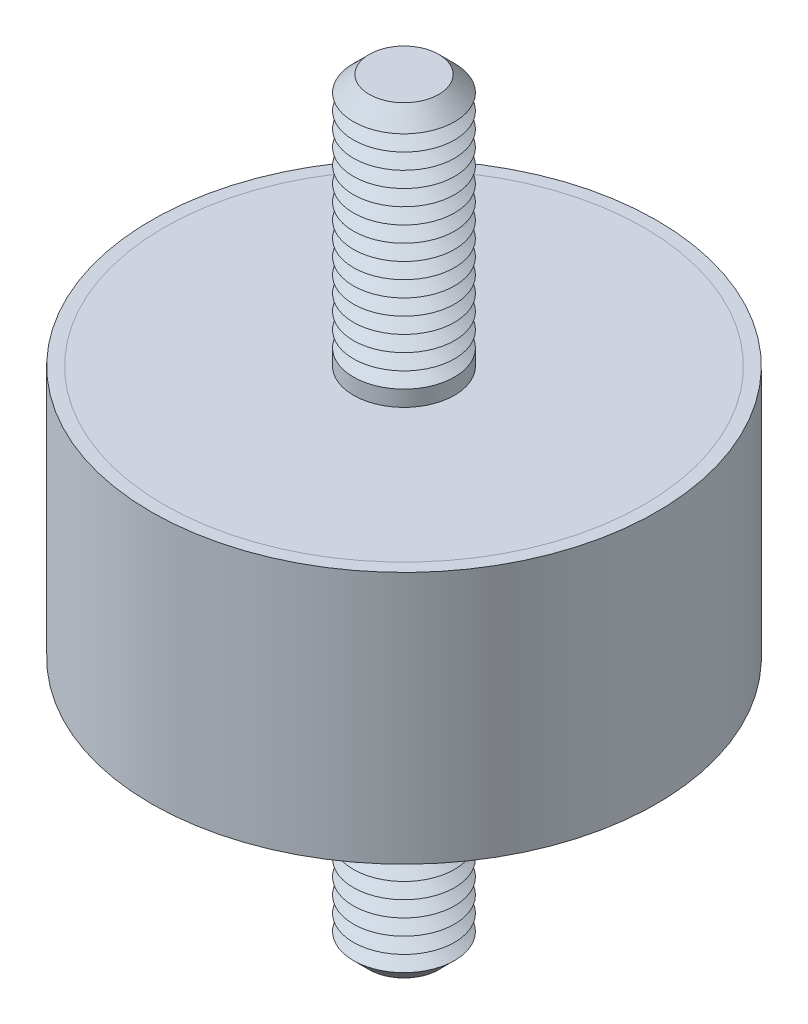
ISO-10303-21;
HEADER;
FILE_DESCRIPTION(('STEP AP214'),'2;1');
FILE_NAME('part.step','',(''),(''),'','','');
FILE_SCHEMA(('AUTOMOTIVE_DESIGN { 1 0 10303 214 1 1 1 1 }'));
ENDSEC;
DATA;
#1=APPLICATION_CONTEXT('core data for automotive mechanical design processes');
#2=APPLICATION_PROTOCOL_DEFINITION('international standard','automotive_design',2000,#1);
#3=PRODUCT_CONTEXT('',#1,'mechanical');
#4=PRODUCT('Part','Part','',(#3));
#5=PRODUCT_RELATED_PRODUCT_CATEGORY('part','',(#4));
#6=PRODUCT_DEFINITION_FORMATION('','',#4);
#7=PRODUCT_DEFINITION_CONTEXT('part definition',#1,'design');
#8=PRODUCT_DEFINITION('design','',#6,#7);
#9=PRODUCT_DEFINITION_SHAPE('','',#8);
#10=(LENGTH_UNIT() NAMED_UNIT(*) SI_UNIT(.MILLI.,.METRE.));
#11=(NAMED_UNIT(*) PLANE_ANGLE_UNIT() SI_UNIT($,.RADIAN.));
#12=(NAMED_UNIT(*) SI_UNIT($,.STERADIAN.) SOLID_ANGLE_UNIT());
#13=UNCERTAINTY_MEASURE_WITH_UNIT(LENGTH_MEASURE(1.E-05),#10,'distance_accuracy_value','');
#14=(GEOMETRIC_REPRESENTATION_CONTEXT(3) GLOBAL_UNCERTAINTY_ASSIGNED_CONTEXT((#13)) GLOBAL_UNIT_ASSIGNED_CONTEXT((#10,
#11,#12)) REPRESENTATION_CONTEXT('',''));
#15=CARTESIAN_POINT('',(0.,0.,0.));
#16=DIRECTION('',(0.,0.,1.));
#17=DIRECTION('',(1.,0.,0.));
#18=AXIS2_PLACEMENT_3D('',#15,#16,#17);
#19=CARTESIAN_POINT('',(0.,-30.,0.));
#20=DIRECTION('',(0.,1.,0.));
#21=DIRECTION('',(0.,0.,1.));
#22=AXIS2_PLACEMENT_3D('',#19,#20,#21);
#23=CYLINDRICAL_SURFACE('',#22,4.);
#24=CARTESIAN_POINT('',(0.,-10.,0.));
#25=DIRECTION('',(0.,-1.,0.));
#26=DIRECTION('',(0.,0.,-1.));
#27=AXIS2_PLACEMENT_3D('',#24,#25,#26);
#28=CIRCLE('',#27,4.);
#29=CARTESIAN_POINT('',(0.,-10.,-4.));
#30=VERTEX_POINT('',#29);
#31=EDGE_CURVE('P0_E21',#30,#30,#28,.T.);
#32=ORIENTED_EDGE('',*,*,#31,.T.);
#33=EDGE_LOOP('',(#32));
#34=FACE_BOUND('',#33,.T.);
#35=CARTESIAN_POINT('',(0.,-11.25,0.));
#36=DIRECTION('',(0.,1.,0.));
#37=DIRECTION('',(0.,0.,1.));
#38=AXIS2_PLACEMENT_3D('',#35,#36,#37);
#39=CIRCLE('',#38,4.);
#40=CARTESIAN_POINT('',(0.,-11.25,4.));
#41=VERTEX_POINT('',#40);
#42=EDGE_CURVE('P0_E33',#41,#41,#39,.T.);
#43=ORIENTED_EDGE('',*,*,#42,.T.);
#44=EDGE_LOOP('',(#43));
#45=FACE_BOUND('',#44,.T.);
#46=ADVANCED_FACE('P0_F14',(#34,#45),#23,.T.);
#47=CARTESIAN_POINT('',(0.,-10.,0.));
#48=DIRECTION('',(0.,1.,0.));
#49=DIRECTION('',(0.,0.,1.));
#50=AXIS2_PLACEMENT_3D('',#47,#48,#49);
#51=CYLINDRICAL_SURFACE('',#50,19.);
#52=CARTESIAN_POINT('',(0.,-10.,0.));
#53=DIRECTION('',(0.,1.,0.));
#54=DIRECTION('',(0.,0.,1.));
#55=AXIS2_PLACEMENT_3D('',#52,#53,#54);
#56=CIRCLE('',#55,19.);
#57=CARTESIAN_POINT('',(0.,-10.,19.));
#58=VERTEX_POINT('',#57);
#59=EDGE_CURVE('P0_E25',#58,#58,#56,.T.);
#60=ORIENTED_EDGE('',*,*,#59,.T.);
#61=EDGE_LOOP('',(#60));
#62=FACE_BOUND('',#61,.T.);
#63=CARTESIAN_POINT('',(0.,-9.,0.));
#64=DIRECTION('',(0.,1.,0.));
#65=DIRECTION('',(0.,0.,1.));
#66=AXIS2_PLACEMENT_3D('',#63,#64,#65);
#67=CIRCLE('',#66,19.);
#68=CARTESIAN_POINT('',(0.,-9.,19.));
#69=VERTEX_POINT('',#68);
#70=EDGE_CURVE('P0_E30',#69,#69,#67,.T.);
#71=ORIENTED_EDGE('',*,*,#70,.F.);
#72=EDGE_LOOP('',(#71));
#73=FACE_BOUND('',#72,.T.);
#74=ADVANCED_FACE('P0_F145',(#62,#73),#51,.T.);
#75=CARTESIAN_POINT('',(0.,-10.,0.));
#76=DIRECTION('',(0.,1.,0.));
#77=DIRECTION('',(0.,0.,1.));
#78=AXIS2_PLACEMENT_3D('',#75,#76,#77);
#79=PLANE('',#78);
#80=ORIENTED_EDGE('',*,*,#31,.F.);
#81=EDGE_LOOP('',(#80));
#82=FACE_BOUND('',#81,.T.);
#83=ORIENTED_EDGE('',*,*,#59,.F.);
#84=EDGE_LOOP('',(#83));
#85=FACE_BOUND('',#84,.T.);
#86=ADVANCED_FACE('P0_F150',(#82,#85),#79,.F.);
#87=CARTESIAN_POINT('',(0.,-9.,0.));
#88=DIRECTION('',(0.,1.,0.));
#89=DIRECTION('',(0.,0.,1.));
#90=AXIS2_PLACEMENT_3D('',#87,#88,#89);
#91=PLANE('',#90);
#92=ORIENTED_EDGE('',*,*,#70,.T.);
#93=EDGE_LOOP('',(#92));
#94=FACE_BOUND('',#93,.T.);
#95=ADVANCED_FACE('P0_F156',(#94),#91,.T.);
#96=CARTESIAN_POINT('',(0.,-11.25,0.));
#97=DIRECTION('',(0.,1.,0.));
#98=DIRECTION('',(0.,0.,1.));
#99=AXIS2_PLACEMENT_3D('',#96,#97,#98);
#100=CONICAL_SURFACE('',#99,4.,1.0471975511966);
#101=CARTESIAN_POINT('',(0.,-11.875,0.));
#102=DIRECTION('',(0.,1.,0.));
#103=DIRECTION('',(0.,0.,1.));
#104=AXIS2_PLACEMENT_3D('',#101,#102,#103);
#105=CIRCLE('',#104,2.91746824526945);
#106=CARTESIAN_POINT('',(0.,-11.875,2.91746824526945));
#107=VERTEX_POINT('',#106);
#108=EDGE_CURVE('P0_E39',#107,#107,#105,.T.);
#109=ORIENTED_EDGE('',*,*,#108,.T.);
#110=EDGE_LOOP('',(#109));
#111=FACE_BOUND('',#110,.T.);
#112=ORIENTED_EDGE('',*,*,#42,.F.);
#113=EDGE_LOOP('',(#112));
#114=FACE_BOUND('',#113,.T.);
#115=ADVANCED_FACE('P0_F159',(#111,#114),#100,.T.);
#116=CARTESIAN_POINT('',(0.,-11.875,0.));
#117=DIRECTION('',(0.,-1.,0.));
#118=DIRECTION('',(0.,0.,-1.));
#119=AXIS2_PLACEMENT_3D('',#116,#117,#118);
#120=CONICAL_SURFACE('',#119,2.91746824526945,1.0471975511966);
#121=CARTESIAN_POINT('',(0.,-12.5,0.));
#122=DIRECTION('',(0.,1.,0.));
#123=DIRECTION('',(0.,0.,1.));
#124=AXIS2_PLACEMENT_3D('',#121,#122,#123);
#125=CIRCLE('',#124,4.);
#126=CARTESIAN_POINT('',(0.,-12.5,4.));
#127=VERTEX_POINT('',#126);
#128=EDGE_CURVE('P0_E43',#127,#127,#125,.T.);
#129=ORIENTED_EDGE('',*,*,#128,.T.);
#130=EDGE_LOOP('',(#129));
#131=FACE_BOUND('',#130,.T.);
#132=ORIENTED_EDGE('',*,*,#108,.F.);
#133=EDGE_LOOP('',(#132));
#134=FACE_BOUND('',#133,.T.);
#135=ADVANCED_FACE('P0_F163',(#131,#134),#120,.T.);
#136=CARTESIAN_POINT('',(0.,-12.5,0.));
#137=DIRECTION('',(0.,1.,0.));
#138=DIRECTION('',(0.,0.,1.));
#139=AXIS2_PLACEMENT_3D('',#136,#137,#138);
#140=CONICAL_SURFACE('',#139,4.,1.0471975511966);
#141=CARTESIAN_POINT('',(0.,-13.125,0.));
#142=DIRECTION('',(0.,1.,0.));
#143=DIRECTION('',(0.,0.,1.));
#144=AXIS2_PLACEMENT_3D('',#141,#142,#143);
#145=CIRCLE('',#144,2.91746824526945);
#146=CARTESIAN_POINT('',(0.,-13.125,2.91746824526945));
#147=VERTEX_POINT('',#146);
#148=EDGE_CURVE('P0_E47',#147,#147,#145,.T.);
#149=ORIENTED_EDGE('',*,*,#148,.T.);
#150=EDGE_LOOP('',(#149));
#151=FACE_BOUND('',#150,.T.);
#152=ORIENTED_EDGE('',*,*,#128,.F.);
#153=EDGE_LOOP('',(#152));
#154=FACE_BOUND('',#153,.T.);
#155=ADVANCED_FACE('P0_F167',(#151,#154),#140,.T.);
#156=CARTESIAN_POINT('',(0.,-13.125,0.));
#157=DIRECTION('',(0.,-1.,0.));
#158=DIRECTION('',(0.,0.,-1.));
#159=AXIS2_PLACEMENT_3D('',#156,#157,#158);
#160=CONICAL_SURFACE('',#159,2.91746824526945,1.0471975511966);
#161=CARTESIAN_POINT('',(0.,-13.75,0.));
#162=DIRECTION('',(0.,1.,0.));
#163=DIRECTION('',(0.,0.,1.));
#164=AXIS2_PLACEMENT_3D('',#161,#162,#163);
#165=CIRCLE('',#164,4.);
#166=CARTESIAN_POINT('',(0.,-13.75,4.));
#167=VERTEX_POINT('',#166);
#168=EDGE_CURVE('P0_E52',#167,#167,#165,.T.);
#169=ORIENTED_EDGE('',*,*,#168,.T.);
#170=EDGE_LOOP('',(#169));
#171=FACE_BOUND('',#170,.T.);
#172=ORIENTED_EDGE('',*,*,#148,.F.);
#173=EDGE_LOOP('',(#172));
#174=FACE_BOUND('',#173,.T.);
#175=ADVANCED_FACE('P0_F174',(#171,#174),#160,.T.);
#176=CARTESIAN_POINT('',(0.,-13.75,0.));
#177=DIRECTION('',(0.,1.,0.));
#178=DIRECTION('',(0.,0.,1.));
#179=AXIS2_PLACEMENT_3D('',#176,#177,#178);
#180=CONICAL_SURFACE('',#179,4.,1.0471975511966);
#181=CARTESIAN_POINT('',(0.,-14.375,0.));
#182=DIRECTION('',(0.,1.,0.));
#183=DIRECTION('',(0.,0.,1.));
#184=AXIS2_PLACEMENT_3D('',#181,#182,#183);
#185=CIRCLE('',#184,2.91746824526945);
#186=CARTESIAN_POINT('',(0.,-14.375,2.91746824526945));
#187=VERTEX_POINT('',#186);
#188=EDGE_CURVE('P0_E55',#187,#187,#185,.T.);
#189=ORIENTED_EDGE('',*,*,#188,.T.);
#190=EDGE_LOOP('',(#189));
#191=FACE_BOUND('',#190,.T.);
#192=ORIENTED_EDGE('',*,*,#168,.F.);
#193=EDGE_LOOP('',(#192));
#194=FACE_BOUND('',#193,.T.);
#195=ADVANCED_FACE('P0_F178',(#191,#194),#180,.T.);
#196=CARTESIAN_POINT('',(0.,-14.375,0.));
#197=DIRECTION('',(0.,-1.,0.));
#198=DIRECTION('',(0.,0.,-1.));
#199=AXIS2_PLACEMENT_3D('',#196,#197,#198);
#200=CONICAL_SURFACE('',#199,2.91746824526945,1.0471975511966);
#201=CARTESIAN_POINT('',(0.,-15.,0.));
#202=DIRECTION('',(0.,1.,0.));
#203=DIRECTION('',(0.,0.,1.));
#204=AXIS2_PLACEMENT_3D('',#201,#202,#203);
#205=CIRCLE('',#204,4.);
#206=CARTESIAN_POINT('',(0.,-15.,4.));
#207=VERTEX_POINT('',#206);
#208=EDGE_CURVE('P0_E58',#207,#207,#205,.T.);
#209=ORIENTED_EDGE('',*,*,#208,.T.);
#210=EDGE_LOOP('',(#209));
#211=FACE_BOUND('',#210,.T.);
#212=ORIENTED_EDGE('',*,*,#188,.F.);
#213=EDGE_LOOP('',(#212));
#214=FACE_BOUND('',#213,.T.);
#215=ADVANCED_FACE('P0_F182',(#211,#214),#200,.T.);
#216=CARTESIAN_POINT('',(0.,-15.,0.));
#217=DIRECTION('',(0.,1.,0.));
#218=DIRECTION('',(0.,0.,1.));
#219=AXIS2_PLACEMENT_3D('',#216,#217,#218);
#220=CONICAL_SURFACE('',#219,4.,1.0471975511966);
#221=CARTESIAN_POINT('',(0.,-15.625,0.));
#222=DIRECTION('',(0.,1.,0.));
#223=DIRECTION('',(0.,0.,1.));
#224=AXIS2_PLACEMENT_3D('',#221,#222,#223);
#225=CIRCLE('',#224,2.91746824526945);
#226=CARTESIAN_POINT('',(0.,-15.625,2.91746824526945));
#227=VERTEX_POINT('',#226);
#228=EDGE_CURVE('P0_E61',#227,#227,#225,.T.);
#229=ORIENTED_EDGE('',*,*,#228,.T.);
#230=EDGE_LOOP('',(#229));
#231=FACE_BOUND('',#230,.T.);
#232=ORIENTED_EDGE('',*,*,#208,.F.);
#233=EDGE_LOOP('',(#232));
#234=FACE_BOUND('',#233,.T.);
#235=ADVANCED_FACE('P0_F186',(#231,#234),#220,.T.);
#236=CARTESIAN_POINT('',(0.,-15.625,0.));
#237=DIRECTION('',(0.,-1.,0.));
#238=DIRECTION('',(0.,0.,-1.));
#239=AXIS2_PLACEMENT_3D('',#236,#237,#238);
#240=CONICAL_SURFACE('',#239,2.91746824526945,1.0471975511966);
#241=CARTESIAN_POINT('',(0.,-16.25,0.));
#242=DIRECTION('',(0.,1.,0.));
#243=DIRECTION('',(0.,0.,1.));
#244=AXIS2_PLACEMENT_3D('',#241,#242,#243);
#245=CIRCLE('',#244,4.);
#246=CARTESIAN_POINT('',(0.,-16.25,4.));
#247=VERTEX_POINT('',#246);
#248=EDGE_CURVE('P0_E64',#247,#247,#245,.T.);
#249=ORIENTED_EDGE('',*,*,#248,.T.);
#250=EDGE_LOOP('',(#249));
#251=FACE_BOUND('',#250,.T.);
#252=ORIENTED_EDGE('',*,*,#228,.F.);
#253=EDGE_LOOP('',(#252));
#254=FACE_BOUND('',#253,.T.);
#255=ADVANCED_FACE('P0_F190',(#251,#254),#240,.T.);
#256=CARTESIAN_POINT('',(0.,-16.25,0.));
#257=DIRECTION('',(0.,1.,0.));
#258=DIRECTION('',(0.,0.,1.));
#259=AXIS2_PLACEMENT_3D('',#256,#257,#258);
#260=CONICAL_SURFACE('',#259,4.,1.0471975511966);
#261=CARTESIAN_POINT('',(0.,-16.875,0.));
#262=DIRECTION('',(0.,1.,0.));
#263=DIRECTION('',(0.,0.,1.));
#264=AXIS2_PLACEMENT_3D('',#261,#262,#263);
#265=CIRCLE('',#264,2.91746824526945);
#266=CARTESIAN_POINT('',(0.,-16.875,2.91746824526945));
#267=VERTEX_POINT('',#266);
#268=EDGE_CURVE('P0_E67',#267,#267,#265,.T.);
#269=ORIENTED_EDGE('',*,*,#268,.T.);
#270=EDGE_LOOP('',(#269));
#271=FACE_BOUND('',#270,.T.);
#272=ORIENTED_EDGE('',*,*,#248,.F.);
#273=EDGE_LOOP('',(#272));
#274=FACE_BOUND('',#273,.T.);
#275=ADVANCED_FACE('P0_F194',(#271,#274),#260,.T.);
#276=CARTESIAN_POINT('',(0.,-16.875,0.));
#277=DIRECTION('',(0.,-1.,0.));
#278=DIRECTION('',(0.,0.,-1.));
#279=AXIS2_PLACEMENT_3D('',#276,#277,#278);
#280=CONICAL_SURFACE('',#279,2.91746824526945,1.0471975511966);
#281=CARTESIAN_POINT('',(0.,-17.5,0.));
#282=DIRECTION('',(0.,1.,0.));
#283=DIRECTION('',(0.,0.,1.));
#284=AXIS2_PLACEMENT_3D('',#281,#282,#283);
#285=CIRCLE('',#284,4.);
#286=CARTESIAN_POINT('',(0.,-17.5,4.));
#287=VERTEX_POINT('',#286);
#288=EDGE_CURVE('P0_E70',#287,#287,#285,.T.);
#289=ORIENTED_EDGE('',*,*,#288,.T.);
#290=EDGE_LOOP('',(#289));
#291=FACE_BOUND('',#290,.T.);
#292=ORIENTED_EDGE('',*,*,#268,.F.);
#293=EDGE_LOOP('',(#292));
#294=FACE_BOUND('',#293,.T.);
#295=ADVANCED_FACE('P0_F198',(#291,#294),#280,.T.);
#296=CARTESIAN_POINT('',(0.,-17.5,0.));
#297=DIRECTION('',(0.,1.,0.));
#298=DIRECTION('',(0.,0.,1.));
#299=AXIS2_PLACEMENT_3D('',#296,#297,#298);
#300=CONICAL_SURFACE('',#299,4.,1.0471975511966);
#301=CARTESIAN_POINT('',(0.,-18.125,0.));
#302=DIRECTION('',(0.,1.,0.));
#303=DIRECTION('',(0.,0.,1.));
#304=AXIS2_PLACEMENT_3D('',#301,#302,#303);
#305=CIRCLE('',#304,2.91746824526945);
#306=CARTESIAN_POINT('',(0.,-18.125,2.91746824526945));
#307=VERTEX_POINT('',#306);
#308=EDGE_CURVE('P0_E73',#307,#307,#305,.T.);
#309=ORIENTED_EDGE('',*,*,#308,.T.);
#310=EDGE_LOOP('',(#309));
#311=FACE_BOUND('',#310,.T.);
#312=ORIENTED_EDGE('',*,*,#288,.F.);
#313=EDGE_LOOP('',(#312));
#314=FACE_BOUND('',#313,.T.);
#315=ADVANCED_FACE('P0_F202',(#311,#314),#300,.T.);
#316=CARTESIAN_POINT('',(0.,-18.125,0.));
#317=DIRECTION('',(0.,-1.,0.));
#318=DIRECTION('',(0.,0.,-1.));
#319=AXIS2_PLACEMENT_3D('',#316,#317,#318);
#320=CONICAL_SURFACE('',#319,2.91746824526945,1.0471975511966);
#321=CARTESIAN_POINT('',(0.,-18.75,0.));
#322=DIRECTION('',(0.,1.,0.));
#323=DIRECTION('',(0.,0.,1.));
#324=AXIS2_PLACEMENT_3D('',#321,#322,#323);
#325=CIRCLE('',#324,4.);
#326=CARTESIAN_POINT('',(0.,-18.75,4.));
#327=VERTEX_POINT('',#326);
#328=EDGE_CURVE('P0_E76',#327,#327,#325,.T.);
#329=ORIENTED_EDGE('',*,*,#328,.T.);
#330=EDGE_LOOP('',(#329));
#331=FACE_BOUND('',#330,.T.);
#332=ORIENTED_EDGE('',*,*,#308,.F.);
#333=EDGE_LOOP('',(#332));
#334=FACE_BOUND('',#333,.T.);
#335=ADVANCED_FACE('P0_F206',(#331,#334),#320,.T.);
#336=CARTESIAN_POINT('',(0.,-18.75,0.));
#337=DIRECTION('',(0.,1.,0.));
#338=DIRECTION('',(0.,0.,1.));
#339=AXIS2_PLACEMENT_3D('',#336,#337,#338);
#340=CONICAL_SURFACE('',#339,4.,1.0471975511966);
#341=CARTESIAN_POINT('',(0.,-19.375,0.));
#342=DIRECTION('',(0.,1.,0.));
#343=DIRECTION('',(0.,0.,1.));
#344=AXIS2_PLACEMENT_3D('',#341,#342,#343);
#345=CIRCLE('',#344,2.91746824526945);
#346=CARTESIAN_POINT('',(0.,-19.375,2.91746824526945));
#347=VERTEX_POINT('',#346);
#348=EDGE_CURVE('P0_E79',#347,#347,#345,.T.);
#349=ORIENTED_EDGE('',*,*,#348,.T.);
#350=EDGE_LOOP('',(#349));
#351=FACE_BOUND('',#350,.T.);
#352=ORIENTED_EDGE('',*,*,#328,.F.);
#353=EDGE_LOOP('',(#352));
#354=FACE_BOUND('',#353,.T.);
#355=ADVANCED_FACE('P0_F210',(#351,#354),#340,.T.);
#356=CARTESIAN_POINT('',(0.,-19.375,0.));
#357=DIRECTION('',(0.,-1.,0.));
#358=DIRECTION('',(0.,0.,-1.));
#359=AXIS2_PLACEMENT_3D('',#356,#357,#358);
#360=CONICAL_SURFACE('',#359,2.91746824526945,1.0471975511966);
#361=CARTESIAN_POINT('',(0.,-20.,0.));
#362=DIRECTION('',(0.,1.,0.));
#363=DIRECTION('',(0.,0.,1.));
#364=AXIS2_PLACEMENT_3D('',#361,#362,#363);
#365=CIRCLE('',#364,4.);
#366=CARTESIAN_POINT('',(0.,-20.,4.));
#367=VERTEX_POINT('',#366);
#368=EDGE_CURVE('P0_E82',#367,#367,#365,.T.);
#369=ORIENTED_EDGE('',*,*,#368,.T.);
#370=EDGE_LOOP('',(#369));
#371=FACE_BOUND('',#370,.T.);
#372=ORIENTED_EDGE('',*,*,#348,.F.);
#373=EDGE_LOOP('',(#372));
#374=FACE_BOUND('',#373,.T.);
#375=ADVANCED_FACE('P0_F214',(#371,#374),#360,.T.);
#376=CARTESIAN_POINT('',(0.,-20.,0.));
#377=DIRECTION('',(0.,1.,0.));
#378=DIRECTION('',(0.,0.,1.));
#379=AXIS2_PLACEMENT_3D('',#376,#377,#378);
#380=CONICAL_SURFACE('',#379,4.,1.0471975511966);
#381=CARTESIAN_POINT('',(0.,-20.625,0.));
#382=DIRECTION('',(0.,1.,0.));
#383=DIRECTION('',(0.,0.,1.));
#384=AXIS2_PLACEMENT_3D('',#381,#382,#383);
#385=CIRCLE('',#384,2.91746824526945);
#386=CARTESIAN_POINT('',(0.,-20.625,2.91746824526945));
#387=VERTEX_POINT('',#386);
#388=EDGE_CURVE('P0_E85',#387,#387,#385,.T.);
#389=ORIENTED_EDGE('',*,*,#388,.T.);
#390=EDGE_LOOP('',(#389));
#391=FACE_BOUND('',#390,.T.);
#392=ORIENTED_EDGE('',*,*,#368,.F.);
#393=EDGE_LOOP('',(#392));
#394=FACE_BOUND('',#393,.T.);
#395=ADVANCED_FACE('P0_F218',(#391,#394),#380,.T.);
#396=CARTESIAN_POINT('',(0.,-20.625,0.));
#397=DIRECTION('',(0.,-1.,0.));
#398=DIRECTION('',(0.,0.,-1.));
#399=AXIS2_PLACEMENT_3D('',#396,#397,#398);
#400=CONICAL_SURFACE('',#399,2.91746824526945,1.0471975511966);
#401=CARTESIAN_POINT('',(0.,-21.25,0.));
#402=DIRECTION('',(0.,1.,0.));
#403=DIRECTION('',(0.,0.,1.));
#404=AXIS2_PLACEMENT_3D('',#401,#402,#403);
#405=CIRCLE('',#404,4.);
#406=CARTESIAN_POINT('',(0.,-21.25,4.));
#407=VERTEX_POINT('',#406);
#408=EDGE_CURVE('P0_E88',#407,#407,#405,.T.);
#409=ORIENTED_EDGE('',*,*,#408,.T.);
#410=EDGE_LOOP('',(#409));
#411=FACE_BOUND('',#410,.T.);
#412=ORIENTED_EDGE('',*,*,#388,.F.);
#413=EDGE_LOOP('',(#412));
#414=FACE_BOUND('',#413,.T.);
#415=ADVANCED_FACE('P0_F222',(#411,#414),#400,.T.);
#416=CARTESIAN_POINT('',(0.,-21.25,0.));
#417=DIRECTION('',(0.,1.,0.));
#418=DIRECTION('',(0.,0.,1.));
#419=AXIS2_PLACEMENT_3D('',#416,#417,#418);
#420=CONICAL_SURFACE('',#419,4.,1.0471975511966);
#421=CARTESIAN_POINT('',(0.,-21.875,0.));
#422=DIRECTION('',(0.,1.,0.));
#423=DIRECTION('',(0.,0.,1.));
#424=AXIS2_PLACEMENT_3D('',#421,#422,#423);
#425=CIRCLE('',#424,2.91746824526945);
#426=CARTESIAN_POINT('',(0.,-21.875,2.91746824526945));
#427=VERTEX_POINT('',#426);
#428=EDGE_CURVE('P0_E91',#427,#427,#425,.T.);
#429=ORIENTED_EDGE('',*,*,#428,.T.);
#430=EDGE_LOOP('',(#429));
#431=FACE_BOUND('',#430,.T.);
#432=ORIENTED_EDGE('',*,*,#408,.F.);
#433=EDGE_LOOP('',(#432));
#434=FACE_BOUND('',#433,.T.);
#435=ADVANCED_FACE('P0_F226',(#431,#434),#420,.T.);
#436=CARTESIAN_POINT('',(0.,-21.875,0.));
#437=DIRECTION('',(0.,-1.,0.));
#438=DIRECTION('',(0.,0.,-1.));
#439=AXIS2_PLACEMENT_3D('',#436,#437,#438);
#440=CONICAL_SURFACE('',#439,2.91746824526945,1.0471975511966);
#441=CARTESIAN_POINT('',(0.,-22.5,0.));
#442=DIRECTION('',(0.,1.,0.));
#443=DIRECTION('',(0.,0.,1.));
#444=AXIS2_PLACEMENT_3D('',#441,#442,#443);
#445=CIRCLE('',#444,4.);
#446=CARTESIAN_POINT('',(0.,-22.5,4.));
#447=VERTEX_POINT('',#446);
#448=EDGE_CURVE('P0_E94',#447,#447,#445,.T.);
#449=ORIENTED_EDGE('',*,*,#448,.T.);
#450=EDGE_LOOP('',(#449));
#451=FACE_BOUND('',#450,.T.);
#452=ORIENTED_EDGE('',*,*,#428,.F.);
#453=EDGE_LOOP('',(#452));
#454=FACE_BOUND('',#453,.T.);
#455=ADVANCED_FACE('P0_F230',(#451,#454),#440,.T.);
#456=CARTESIAN_POINT('',(0.,-22.5,0.));
#457=DIRECTION('',(0.,1.,0.));
#458=DIRECTION('',(0.,0.,1.));
#459=AXIS2_PLACEMENT_3D('',#456,#457,#458);
#460=CONICAL_SURFACE('',#459,4.,1.0471975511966);
#461=CARTESIAN_POINT('',(0.,-23.125,0.));
#462=DIRECTION('',(0.,1.,0.));
#463=DIRECTION('',(0.,0.,1.));
#464=AXIS2_PLACEMENT_3D('',#461,#462,#463);
#465=CIRCLE('',#464,2.91746824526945);
#466=CARTESIAN_POINT('',(0.,-23.125,2.91746824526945));
#467=VERTEX_POINT('',#466);
#468=EDGE_CURVE('P0_E97',#467,#467,#465,.T.);
#469=ORIENTED_EDGE('',*,*,#468,.T.);
#470=EDGE_LOOP('',(#469));
#471=FACE_BOUND('',#470,.T.);
#472=ORIENTED_EDGE('',*,*,#448,.F.);
#473=EDGE_LOOP('',(#472));
#474=FACE_BOUND('',#473,.T.);
#475=ADVANCED_FACE('P0_F234',(#471,#474),#460,.T.);
#476=CARTESIAN_POINT('',(0.,-23.125,0.));
#477=DIRECTION('',(0.,-1.,0.));
#478=DIRECTION('',(0.,0.,-1.));
#479=AXIS2_PLACEMENT_3D('',#476,#477,#478);
#480=CONICAL_SURFACE('',#479,2.91746824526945,1.0471975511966);
#481=CARTESIAN_POINT('',(0.,-23.75,0.));
#482=DIRECTION('',(0.,1.,0.));
#483=DIRECTION('',(0.,0.,1.));
#484=AXIS2_PLACEMENT_3D('',#481,#482,#483);
#485=CIRCLE('',#484,4.);
#486=CARTESIAN_POINT('',(0.,-23.75,4.));
#487=VERTEX_POINT('',#486);
#488=EDGE_CURVE('P0_E100',#487,#487,#485,.T.);
#489=ORIENTED_EDGE('',*,*,#488,.T.);
#490=EDGE_LOOP('',(#489));
#491=FACE_BOUND('',#490,.T.);
#492=ORIENTED_EDGE('',*,*,#468,.F.);
#493=EDGE_LOOP('',(#492));
#494=FACE_BOUND('',#493,.T.);
#495=ADVANCED_FACE('P0_F238',(#491,#494),#480,.T.);
#496=CARTESIAN_POINT('',(0.,-23.75,0.));
#497=DIRECTION('',(0.,1.,0.));
#498=DIRECTION('',(0.,0.,1.));
#499=AXIS2_PLACEMENT_3D('',#496,#497,#498);
#500=CONICAL_SURFACE('',#499,4.,1.0471975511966);
#501=CARTESIAN_POINT('',(0.,-24.375,0.));
#502=DIRECTION('',(0.,1.,0.));
#503=DIRECTION('',(0.,0.,1.));
#504=AXIS2_PLACEMENT_3D('',#501,#502,#503);
#505=CIRCLE('',#504,2.91746824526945);
#506=CARTESIAN_POINT('',(0.,-24.375,2.91746824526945));
#507=VERTEX_POINT('',#506);
#508=EDGE_CURVE('P0_E103',#507,#507,#505,.T.);
#509=ORIENTED_EDGE('',*,*,#508,.T.);
#510=EDGE_LOOP('',(#509));
#511=FACE_BOUND('',#510,.T.);
#512=ORIENTED_EDGE('',*,*,#488,.F.);
#513=EDGE_LOOP('',(#512));
#514=FACE_BOUND('',#513,.T.);
#515=ADVANCED_FACE('P0_F242',(#511,#514),#500,.T.);
#516=CARTESIAN_POINT('',(0.,-24.375,0.));
#517=DIRECTION('',(0.,-1.,0.));
#518=DIRECTION('',(0.,0.,-1.));
#519=AXIS2_PLACEMENT_3D('',#516,#517,#518);
#520=CONICAL_SURFACE('',#519,2.91746824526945,1.0471975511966);
#521=CARTESIAN_POINT('',(0.,-25.,0.));
#522=DIRECTION('',(0.,1.,0.));
#523=DIRECTION('',(0.,0.,1.));
#524=AXIS2_PLACEMENT_3D('',#521,#522,#523);
#525=CIRCLE('',#524,4.);
#526=CARTESIAN_POINT('',(0.,-25.,4.));
#527=VERTEX_POINT('',#526);
#528=EDGE_CURVE('P0_E106',#527,#527,#525,.T.);
#529=ORIENTED_EDGE('',*,*,#528,.T.);
#530=EDGE_LOOP('',(#529));
#531=FACE_BOUND('',#530,.T.);
#532=ORIENTED_EDGE('',*,*,#508,.F.);
#533=EDGE_LOOP('',(#532));
#534=FACE_BOUND('',#533,.T.);
#535=ADVANCED_FACE('P0_F246',(#531,#534),#520,.T.);
#536=CARTESIAN_POINT('',(0.,-25.,0.));
#537=DIRECTION('',(0.,1.,0.));
#538=DIRECTION('',(0.,0.,1.));
#539=AXIS2_PLACEMENT_3D('',#536,#537,#538);
#540=CONICAL_SURFACE('',#539,4.,1.0471975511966);
#541=CARTESIAN_POINT('',(0.,-25.625,0.));
#542=DIRECTION('',(0.,1.,0.));
#543=DIRECTION('',(0.,0.,1.));
#544=AXIS2_PLACEMENT_3D('',#541,#542,#543);
#545=CIRCLE('',#544,2.91746824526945);
#546=CARTESIAN_POINT('',(0.,-25.625,2.91746824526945));
#547=VERTEX_POINT('',#546);
#548=EDGE_CURVE('P0_E109',#547,#547,#545,.T.);
#549=ORIENTED_EDGE('',*,*,#548,.T.);
#550=EDGE_LOOP('',(#549));
#551=FACE_BOUND('',#550,.T.);
#552=ORIENTED_EDGE('',*,*,#528,.F.);
#553=EDGE_LOOP('',(#552));
#554=FACE_BOUND('',#553,.T.);
#555=ADVANCED_FACE('P0_F250',(#551,#554),#540,.T.);
#556=CARTESIAN_POINT('',(0.,-25.625,0.));
#557=DIRECTION('',(0.,-1.,0.));
#558=DIRECTION('',(0.,0.,-1.));
#559=AXIS2_PLACEMENT_3D('',#556,#557,#558);
#560=CONICAL_SURFACE('',#559,2.91746824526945,1.0471975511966);
#561=CARTESIAN_POINT('',(0.,-26.25,0.));
#562=DIRECTION('',(0.,1.,0.));
#563=DIRECTION('',(0.,0.,1.));
#564=AXIS2_PLACEMENT_3D('',#561,#562,#563);
#565=CIRCLE('',#564,4.);
#566=CARTESIAN_POINT('',(0.,-26.25,4.));
#567=VERTEX_POINT('',#566);
#568=EDGE_CURVE('P0_E112',#567,#567,#565,.T.);
#569=ORIENTED_EDGE('',*,*,#568,.T.);
#570=EDGE_LOOP('',(#569));
#571=FACE_BOUND('',#570,.T.);
#572=ORIENTED_EDGE('',*,*,#548,.F.);
#573=EDGE_LOOP('',(#572));
#574=FACE_BOUND('',#573,.T.);
#575=ADVANCED_FACE('P0_F254',(#571,#574),#560,.T.);
#576=CARTESIAN_POINT('',(0.,-26.25,0.));
#577=DIRECTION('',(0.,1.,0.));
#578=DIRECTION('',(0.,0.,1.));
#579=AXIS2_PLACEMENT_3D('',#576,#577,#578);
#580=CONICAL_SURFACE('',#579,4.,1.0471975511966);
#581=CARTESIAN_POINT('',(0.,-26.875,0.));
#582=DIRECTION('',(0.,1.,0.));
#583=DIRECTION('',(0.,0.,1.));
#584=AXIS2_PLACEMENT_3D('',#581,#582,#583);
#585=CIRCLE('',#584,2.91746824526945);
#586=CARTESIAN_POINT('',(0.,-26.875,2.91746824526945));
#587=VERTEX_POINT('',#586);
#588=EDGE_CURVE('P0_E115',#587,#587,#585,.T.);
#589=ORIENTED_EDGE('',*,*,#588,.T.);
#590=EDGE_LOOP('',(#589));
#591=FACE_BOUND('',#590,.T.);
#592=ORIENTED_EDGE('',*,*,#568,.F.);
#593=EDGE_LOOP('',(#592));
#594=FACE_BOUND('',#593,.T.);
#595=ADVANCED_FACE('P0_F258',(#591,#594),#580,.T.);
#596=CARTESIAN_POINT('',(0.,-26.875,0.));
#597=DIRECTION('',(0.,-1.,0.));
#598=DIRECTION('',(0.,0.,-1.));
#599=AXIS2_PLACEMENT_3D('',#596,#597,#598);
#600=CONICAL_SURFACE('',#599,2.91746824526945,1.0471975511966);
#601=CARTESIAN_POINT('',(0.,-27.5,0.));
#602=DIRECTION('',(0.,1.,0.));
#603=DIRECTION('',(0.,0.,1.));
#604=AXIS2_PLACEMENT_3D('',#601,#602,#603);
#605=CIRCLE('',#604,4.);
#606=CARTESIAN_POINT('',(0.,-27.5,4.));
#607=VERTEX_POINT('',#606);
#608=EDGE_CURVE('P0_E118',#607,#607,#605,.T.);
#609=ORIENTED_EDGE('',*,*,#608,.T.);
#610=EDGE_LOOP('',(#609));
#611=FACE_BOUND('',#610,.T.);
#612=ORIENTED_EDGE('',*,*,#588,.F.);
#613=EDGE_LOOP('',(#612));
#614=FACE_BOUND('',#613,.T.);
#615=ADVANCED_FACE('P0_F142',(#611,#614),#600,.T.);
#616=CARTESIAN_POINT('',(0.,-27.5,0.));
#617=DIRECTION('',(0.,1.,0.));
#618=DIRECTION('',(0.,0.,1.));
#619=AXIS2_PLACEMENT_3D('',#616,#617,#618);
#620=CONICAL_SURFACE('',#619,4.,1.0471975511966);
#621=CARTESIAN_POINT('',(0.,-28.125,0.));
#622=DIRECTION('',(0.,1.,0.));
#623=DIRECTION('',(0.,0.,1.));
#624=AXIS2_PLACEMENT_3D('',#621,#622,#623);
#625=CIRCLE('',#624,2.91746824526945);
#626=CARTESIAN_POINT('',(0.,-28.125,2.91746824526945));
#627=VERTEX_POINT('',#626);
#628=EDGE_CURVE('P0_E124',#627,#627,#625,.T.);
#629=ORIENTED_EDGE('',*,*,#628,.T.);
#630=EDGE_LOOP('',(#629));
#631=FACE_BOUND('',#630,.T.);
#632=ORIENTED_EDGE('',*,*,#608,.F.);
#633=EDGE_LOOP('',(#632));
#634=FACE_BOUND('',#633,.T.);
#635=ADVANCED_FACE('P0_F128',(#631,#634),#620,.T.);
#636=CARTESIAN_POINT('',(0.,-28.125,0.));
#637=DIRECTION('',(0.,-1.,0.));
#638=DIRECTION('',(0.,0.,-1.));
#639=AXIS2_PLACEMENT_3D('',#636,#637,#638);
#640=CONICAL_SURFACE('',#639,2.91746824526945,1.0471975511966);
#641=CARTESIAN_POINT('',(0.,-28.75,0.));
#642=DIRECTION('',(0.,1.,0.));
#643=DIRECTION('',(0.,0.,1.));
#644=AXIS2_PLACEMENT_3D('',#641,#642,#643);
#645=CIRCLE('',#644,4.);
#646=CARTESIAN_POINT('',(0.,-28.75,4.));
#647=VERTEX_POINT('',#646);
#648=EDGE_CURVE('P0_E121',#647,#647,#645,.T.);
#649=ORIENTED_EDGE('',*,*,#648,.T.);
#650=EDGE_LOOP('',(#649));
#651=FACE_BOUND('',#650,.T.);
#652=ORIENTED_EDGE('',*,*,#628,.F.);
#653=EDGE_LOOP('',(#652));
#654=FACE_BOUND('',#653,.T.);
#655=ADVANCED_FACE('P0_F131',(#651,#654),#640,.T.);
#656=CARTESIAN_POINT('',(0.,-30.,0.));
#657=DIRECTION('',(0.,-1.,0.));
#658=DIRECTION('',(0.,0.,-1.));
#659=AXIS2_PLACEMENT_3D('',#656,#657,#658);
#660=PLANE('',#659);
#661=CARTESIAN_POINT('',(0.,-30.,0.));
#662=DIRECTION('',(0.,-1.,0.));
#663=DIRECTION('',(0.,0.,-1.));
#664=AXIS2_PLACEMENT_3D('',#661,#662,#663);
#665=CIRCLE('',#664,2.75);
#666=CARTESIAN_POINT('',(0.,-30.,-2.75));
#667=VERTEX_POINT('',#666);
#668=EDGE_CURVE('P0_E10',#667,#667,#665,.T.);
#669=ORIENTED_EDGE('',*,*,#668,.T.);
#670=EDGE_LOOP('',(#669));
#671=FACE_BOUND('',#670,.T.);
#672=ADVANCED_FACE('P0_F133',(#671),#660,.T.);
#673=CARTESIAN_POINT('',(0.,-30.,0.));
#674=DIRECTION('',(0.,1.,0.));
#675=DIRECTION('',(0.,0.,1.));
#676=AXIS2_PLACEMENT_3D('',#673,#674,#675);
#677=CONICAL_SURFACE('',#676,2.75,0.785398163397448);
#678=ORIENTED_EDGE('',*,*,#648,.F.);
#679=EDGE_LOOP('',(#678));
#680=FACE_BOUND('',#679,.T.);
#681=ORIENTED_EDGE('',*,*,#668,.F.);
#682=EDGE_LOOP('',(#681));
#683=FACE_BOUND('',#682,.T.);
#684=ADVANCED_FACE('P0_F16',(#680,#683),#677,.T.);
#685=CLOSED_SHELL('',(#46,#74,#86,#95,#115,#135,#155,#175,#195,#215,#235,#255,#275,#295,#315,
#335,#355,#375,#395,#415,#435,#455,#475,#495,#515,#535,#555,#575,#595,#615,#635,#655,#672,#684));
#686=MANIFOLD_SOLID_BREP('P0_B1',#685);
#687=CARTESIAN_POINT('',(0.,30.,0.));
#688=DIRECTION('',(0.,-1.,0.));
#689=DIRECTION('',(0.,0.,-1.));
#690=AXIS2_PLACEMENT_3D('',#687,#688,#689);
#691=CYLINDRICAL_SURFACE('',#690,4.);
#692=CARTESIAN_POINT('',(0.,11.25,0.));
#693=DIRECTION('',(0.,1.,0.));
#694=DIRECTION('',(0.,0.,1.));
#695=AXIS2_PLACEMENT_3D('',#692,#693,#694);
#696=CIRCLE('',#695,4.);
#697=CARTESIAN_POINT('',(0.,11.25,4.));
#698=VERTEX_POINT('',#697);
#699=EDGE_CURVE('P1_E33',#698,#698,#696,.T.);
#700=ORIENTED_EDGE('',*,*,#699,.F.);
#701=EDGE_LOOP('',(#700));
#702=FACE_BOUND('',#701,.T.);
#703=CARTESIAN_POINT('',(0.,10.,0.));
#704=DIRECTION('',(0.,1.,0.));
#705=DIRECTION('',(0.,0.,1.));
#706=AXIS2_PLACEMENT_3D('',#703,#704,#705);
#707=CIRCLE('',#706,4.);
#708=CARTESIAN_POINT('',(0.,10.,4.));
#709=VERTEX_POINT('',#708);
#710=EDGE_CURVE('P1_E21',#709,#709,#707,.T.);
#711=ORIENTED_EDGE('',*,*,#710,.T.);
#712=EDGE_LOOP('',(#711));
#713=FACE_BOUND('',#712,.T.);
#714=ADVANCED_FACE('P1_F14',(#702,#713),#691,.T.);
#715=CARTESIAN_POINT('',(0.,10.,0.));
#716=DIRECTION('',(0.,-1.,0.));
#717=DIRECTION('',(0.,0.,-1.));
#718=AXIS2_PLACEMENT_3D('',#715,#716,#717);
#719=CYLINDRICAL_SURFACE('',#718,19.);
#720=CARTESIAN_POINT('',(0.,10.,0.));
#721=DIRECTION('',(0.,1.,0.));
#722=DIRECTION('',(0.,0.,1.));
#723=AXIS2_PLACEMENT_3D('',#720,#721,#722);
#724=CIRCLE('',#723,19.);
#725=CARTESIAN_POINT('',(0.,10.,19.));
#726=VERTEX_POINT('',#725);
#727=EDGE_CURVE('P1_E25',#726,#726,#724,.T.);
#728=ORIENTED_EDGE('',*,*,#727,.F.);
#729=EDGE_LOOP('',(#728));
#730=FACE_BOUND('',#729,.T.);
#731=CARTESIAN_POINT('',(0.,9.,0.));
#732=DIRECTION('',(0.,1.,0.));
#733=DIRECTION('',(0.,0.,1.));
#734=AXIS2_PLACEMENT_3D('',#731,#732,#733);
#735=CIRCLE('',#734,19.);
#736=CARTESIAN_POINT('',(0.,9.,19.));
#737=VERTEX_POINT('',#736);
#738=EDGE_CURVE('P1_E30',#737,#737,#735,.T.);
#739=ORIENTED_EDGE('',*,*,#738,.T.);
#740=EDGE_LOOP('',(#739));
#741=FACE_BOUND('',#740,.T.);
#742=ADVANCED_FACE('P1_F292',(#730,#741),#719,.T.);
#743=CARTESIAN_POINT('',(0.,10.,0.));
#744=DIRECTION('',(0.,1.,0.));
#745=DIRECTION('',(0.,0.,1.));
#746=AXIS2_PLACEMENT_3D('',#743,#744,#745);
#747=PLANE('',#746);
#748=ORIENTED_EDGE('',*,*,#710,.F.);
#749=EDGE_LOOP('',(#748));
#750=FACE_BOUND('',#749,.T.);
#751=ORIENTED_EDGE('',*,*,#727,.T.);
#752=EDGE_LOOP('',(#751));
#753=FACE_BOUND('',#752,.T.);
#754=ADVANCED_FACE('P1_F298',(#750,#753),#747,.T.);
#755=CARTESIAN_POINT('',(0.,9.,0.));
#756=DIRECTION('',(0.,1.,0.));
#757=DIRECTION('',(0.,0.,1.));
#758=AXIS2_PLACEMENT_3D('',#755,#756,#757);
#759=PLANE('',#758);
#760=ORIENTED_EDGE('',*,*,#738,.F.);
#761=EDGE_LOOP('',(#760));
#762=FACE_BOUND('',#761,.T.);
#763=ADVANCED_FACE('P1_F288',(#762),#759,.F.);
#764=CARTESIAN_POINT('',(0.,11.25,0.));
#765=DIRECTION('',(0.,-1.,0.));
#766=DIRECTION('',(0.,0.,-1.));
#767=AXIS2_PLACEMENT_3D('',#764,#765,#766);
#768=CONICAL_SURFACE('',#767,4.,1.0471975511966);
#769=CARTESIAN_POINT('',(0.,11.875,0.));
#770=DIRECTION('',(0.,1.,0.));
#771=DIRECTION('',(0.,0.,1.));
#772=AXIS2_PLACEMENT_3D('',#769,#770,#771);
#773=CIRCLE('',#772,2.91746824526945);
#774=CARTESIAN_POINT('',(0.,11.875,2.91746824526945));
#775=VERTEX_POINT('',#774);
#776=EDGE_CURVE('P1_E39',#775,#775,#773,.T.);
#777=ORIENTED_EDGE('',*,*,#776,.F.);
#778=EDGE_LOOP('',(#777));
#779=FACE_BOUND('',#778,.T.);
#780=ORIENTED_EDGE('',*,*,#699,.T.);
#781=EDGE_LOOP('',(#780));
#782=FACE_BOUND('',#781,.T.);
#783=ADVANCED_FACE('P1_F282',(#779,#782),#768,.T.);
#784=CARTESIAN_POINT('',(0.,11.875,0.));
#785=DIRECTION('',(0.,1.,0.));
#786=DIRECTION('',(0.,0.,1.));
#787=AXIS2_PLACEMENT_3D('',#784,#785,#786);
#788=CONICAL_SURFACE('',#787,2.91746824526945,1.0471975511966);
#789=CARTESIAN_POINT('',(0.,12.5,0.));
#790=DIRECTION('',(0.,1.,0.));
#791=DIRECTION('',(0.,0.,1.));
#792=AXIS2_PLACEMENT_3D('',#789,#790,#791);
#793=CIRCLE('',#792,4.);
#794=CARTESIAN_POINT('',(0.,12.5,4.));
#795=VERTEX_POINT('',#794);
#796=EDGE_CURVE('P1_E43',#795,#795,#793,.T.);
#797=ORIENTED_EDGE('',*,*,#796,.F.);
#798=EDGE_LOOP('',(#797));
#799=FACE_BOUND('',#798,.T.);
#800=ORIENTED_EDGE('',*,*,#776,.T.);
#801=EDGE_LOOP('',(#800));
#802=FACE_BOUND('',#801,.T.);
#803=ADVANCED_FACE('P1_F277',(#799,#802),#788,.T.);
#804=CARTESIAN_POINT('',(0.,12.5,0.));
#805=DIRECTION('',(0.,-1.,0.));
#806=DIRECTION('',(0.,0.,-1.));
#807=AXIS2_PLACEMENT_3D('',#804,#805,#806);
#808=CONICAL_SURFACE('',#807,4.,1.0471975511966);
#809=CARTESIAN_POINT('',(0.,13.125,0.));
#810=DIRECTION('',(0.,1.,0.));
#811=DIRECTION('',(0.,0.,1.));
#812=AXIS2_PLACEMENT_3D('',#809,#810,#811);
#813=CIRCLE('',#812,2.91746824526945);
#814=CARTESIAN_POINT('',(0.,13.125,2.91746824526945));
#815=VERTEX_POINT('',#814);
#816=EDGE_CURVE('P1_E47',#815,#815,#813,.T.);
#817=ORIENTED_EDGE('',*,*,#816,.F.);
#818=EDGE_LOOP('',(#817));
#819=FACE_BOUND('',#818,.T.);
#820=ORIENTED_EDGE('',*,*,#796,.T.);
#821=EDGE_LOOP('',(#820));
#822=FACE_BOUND('',#821,.T.);
#823=ADVANCED_FACE('P1_F271',(#819,#822),#808,.T.);
#824=CARTESIAN_POINT('',(0.,13.125,0.));
#825=DIRECTION('',(0.,1.,0.));
#826=DIRECTION('',(0.,0.,1.));
#827=AXIS2_PLACEMENT_3D('',#824,#825,#826);
#828=CONICAL_SURFACE('',#827,2.91746824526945,1.0471975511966);
#829=CARTESIAN_POINT('',(0.,13.75,0.));
#830=DIRECTION('',(0.,1.,0.));
#831=DIRECTION('',(0.,0.,1.));
#832=AXIS2_PLACEMENT_3D('',#829,#830,#831);
#833=CIRCLE('',#832,4.);
#834=CARTESIAN_POINT('',(0.,13.75,4.));
#835=VERTEX_POINT('',#834);
#836=EDGE_CURVE('P1_E52',#835,#835,#833,.T.);
#837=ORIENTED_EDGE('',*,*,#836,.F.);
#838=EDGE_LOOP('',(#837));
#839=FACE_BOUND('',#838,.T.);
#840=ORIENTED_EDGE('',*,*,#816,.T.);
#841=EDGE_LOOP('',(#840));
#842=FACE_BOUND('',#841,.T.);
#843=ADVANCED_FACE('P1_F265',(#839,#842),#828,.T.);
#844=CARTESIAN_POINT('',(0.,13.75,0.));
#845=DIRECTION('',(0.,-1.,0.));
#846=DIRECTION('',(0.,0.,-1.));
#847=AXIS2_PLACEMENT_3D('',#844,#845,#846);
#848=CONICAL_SURFACE('',#847,4.,1.0471975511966);
#849=CARTESIAN_POINT('',(0.,14.375,0.));
#850=DIRECTION('',(0.,1.,0.));
#851=DIRECTION('',(0.,0.,1.));
#852=AXIS2_PLACEMENT_3D('',#849,#850,#851);
#853=CIRCLE('',#852,2.91746824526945);
#854=CARTESIAN_POINT('',(0.,14.375,2.91746824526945));
#855=VERTEX_POINT('',#854);
#856=EDGE_CURVE('P1_E55',#855,#855,#853,.T.);
#857=ORIENTED_EDGE('',*,*,#856,.F.);
#858=EDGE_LOOP('',(#857));
#859=FACE_BOUND('',#858,.T.);
#860=ORIENTED_EDGE('',*,*,#836,.T.);
#861=EDGE_LOOP('',(#860));
#862=FACE_BOUND('',#861,.T.);
#863=ADVANCED_FACE('P1_F259',(#859,#862),#848,.T.);
#864=CARTESIAN_POINT('',(0.,14.375,0.));
#865=DIRECTION('',(0.,1.,0.));
#866=DIRECTION('',(0.,0.,1.));
#867=AXIS2_PLACEMENT_3D('',#864,#865,#866);
#868=CONICAL_SURFACE('',#867,2.91746824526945,1.0471975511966);
#869=CARTESIAN_POINT('',(0.,15.,0.));
#870=DIRECTION('',(0.,1.,0.));
#871=DIRECTION('',(0.,0.,1.));
#872=AXIS2_PLACEMENT_3D('',#869,#870,#871);
#873=CIRCLE('',#872,4.);
#874=CARTESIAN_POINT('',(0.,15.,4.));
#875=VERTEX_POINT('',#874);
#876=EDGE_CURVE('P1_E58',#875,#875,#873,.T.);
#877=ORIENTED_EDGE('',*,*,#876,.F.);
#878=EDGE_LOOP('',(#877));
#879=FACE_BOUND('',#878,.T.);
#880=ORIENTED_EDGE('',*,*,#856,.T.);
#881=EDGE_LOOP('',(#880));
#882=FACE_BOUND('',#881,.T.);
#883=ADVANCED_FACE('P1_F253',(#879,#882),#868,.T.);
#884=CARTESIAN_POINT('',(0.,15.,0.));
#885=DIRECTION('',(0.,-1.,0.));
#886=DIRECTION('',(0.,0.,-1.));
#887=AXIS2_PLACEMENT_3D('',#884,#885,#886);
#888=CONICAL_SURFACE('',#887,4.,1.0471975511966);
#889=CARTESIAN_POINT('',(0.,15.625,0.));
#890=DIRECTION('',(0.,1.,0.));
#891=DIRECTION('',(0.,0.,1.));
#892=AXIS2_PLACEMENT_3D('',#889,#890,#891);
#893=CIRCLE('',#892,2.91746824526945);
#894=CARTESIAN_POINT('',(0.,15.625,2.91746824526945));
#895=VERTEX_POINT('',#894);
#896=EDGE_CURVE('P1_E61',#895,#895,#893,.T.);
#897=ORIENTED_EDGE('',*,*,#896,.F.);
#898=EDGE_LOOP('',(#897));
#899=FACE_BOUND('',#898,.T.);
#900=ORIENTED_EDGE('',*,*,#876,.T.);
#901=EDGE_LOOP('',(#900));
#902=FACE_BOUND('',#901,.T.);
#903=ADVANCED_FACE('P1_F247',(#899,#902),#888,.T.);
#904=CARTESIAN_POINT('',(0.,15.625,0.));
#905=DIRECTION('',(0.,1.,0.));
#906=DIRECTION('',(0.,0.,1.));
#907=AXIS2_PLACEMENT_3D('',#904,#905,#906);
#908=CONICAL_SURFACE('',#907,2.91746824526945,1.0471975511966);
#909=CARTESIAN_POINT('',(0.,16.25,0.));
#910=DIRECTION('',(0.,1.,0.));
#911=DIRECTION('',(0.,0.,1.));
#912=AXIS2_PLACEMENT_3D('',#909,#910,#911);
#913=CIRCLE('',#912,4.);
#914=CARTESIAN_POINT('',(0.,16.25,4.));
#915=VERTEX_POINT('',#914);
#916=EDGE_CURVE('P1_E64',#915,#915,#913,.T.);
#917=ORIENTED_EDGE('',*,*,#916,.F.);
#918=EDGE_LOOP('',(#917));
#919=FACE_BOUND('',#918,.T.);
#920=ORIENTED_EDGE('',*,*,#896,.T.);
#921=EDGE_LOOP('',(#920));
#922=FACE_BOUND('',#921,.T.);
#923=ADVANCED_FACE('P1_F241',(#919,#922),#908,.T.);
#924=CARTESIAN_POINT('',(0.,16.25,0.));
#925=DIRECTION('',(0.,-1.,0.));
#926=DIRECTION('',(0.,0.,-1.));
#927=AXIS2_PLACEMENT_3D('',#924,#925,#926);
#928=CONICAL_SURFACE('',#927,4.,1.0471975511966);
#929=CARTESIAN_POINT('',(0.,16.875,0.));
#930=DIRECTION('',(0.,1.,0.));
#931=DIRECTION('',(0.,0.,1.));
#932=AXIS2_PLACEMENT_3D('',#929,#930,#931);
#933=CIRCLE('',#932,2.91746824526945);
#934=CARTESIAN_POINT('',(0.,16.875,2.91746824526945));
#935=VERTEX_POINT('',#934);
#936=EDGE_CURVE('P1_E67',#935,#935,#933,.T.);
#937=ORIENTED_EDGE('',*,*,#936,.F.);
#938=EDGE_LOOP('',(#937));
#939=FACE_BOUND('',#938,.T.);
#940=ORIENTED_EDGE('',*,*,#916,.T.);
#941=EDGE_LOOP('',(#940));
#942=FACE_BOUND('',#941,.T.);
#943=ADVANCED_FACE('P1_F235',(#939,#942),#928,.T.);
#944=CARTESIAN_POINT('',(0.,16.875,0.));
#945=DIRECTION('',(0.,1.,0.));
#946=DIRECTION('',(0.,0.,1.));
#947=AXIS2_PLACEMENT_3D('',#944,#945,#946);
#948=CONICAL_SURFACE('',#947,2.91746824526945,1.0471975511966);
#949=CARTESIAN_POINT('',(0.,17.5,0.));
#950=DIRECTION('',(0.,1.,0.));
#951=DIRECTION('',(0.,0.,1.));
#952=AXIS2_PLACEMENT_3D('',#949,#950,#951);
#953=CIRCLE('',#952,4.);
#954=CARTESIAN_POINT('',(0.,17.5,4.));
#955=VERTEX_POINT('',#954);
#956=EDGE_CURVE('P1_E70',#955,#955,#953,.T.);
#957=ORIENTED_EDGE('',*,*,#956,.F.);
#958=EDGE_LOOP('',(#957));
#959=FACE_BOUND('',#958,.T.);
#960=ORIENTED_EDGE('',*,*,#936,.T.);
#961=EDGE_LOOP('',(#960));
#962=FACE_BOUND('',#961,.T.);
#963=ADVANCED_FACE('P1_F229',(#959,#962),#948,.T.);
#964=CARTESIAN_POINT('',(0.,17.5,0.));
#965=DIRECTION('',(0.,-1.,0.));
#966=DIRECTION('',(0.,0.,-1.));
#967=AXIS2_PLACEMENT_3D('',#964,#965,#966);
#968=CONICAL_SURFACE('',#967,4.,1.0471975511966);
#969=CARTESIAN_POINT('',(0.,18.125,0.));
#970=DIRECTION('',(0.,1.,0.));
#971=DIRECTION('',(0.,0.,1.));
#972=AXIS2_PLACEMENT_3D('',#969,#970,#971);
#973=CIRCLE('',#972,2.91746824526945);
#974=CARTESIAN_POINT('',(0.,18.125,2.91746824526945));
#975=VERTEX_POINT('',#974);
#976=EDGE_CURVE('P1_E73',#975,#975,#973,.T.);
#977=ORIENTED_EDGE('',*,*,#976,.F.);
#978=EDGE_LOOP('',(#977));
#979=FACE_BOUND('',#978,.T.);
#980=ORIENTED_EDGE('',*,*,#956,.T.);
#981=EDGE_LOOP('',(#980));
#982=FACE_BOUND('',#981,.T.);
#983=ADVANCED_FACE('P1_F223',(#979,#982),#968,.T.);
#984=CARTESIAN_POINT('',(0.,18.125,0.));
#985=DIRECTION('',(0.,1.,0.));
#986=DIRECTION('',(0.,0.,1.));
#987=AXIS2_PLACEMENT_3D('',#984,#985,#986);
#988=CONICAL_SURFACE('',#987,2.91746824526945,1.0471975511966);
#989=CARTESIAN_POINT('',(0.,18.75,0.));
#990=DIRECTION('',(0.,1.,0.));
#991=DIRECTION('',(0.,0.,1.));
#992=AXIS2_PLACEMENT_3D('',#989,#990,#991);
#993=CIRCLE('',#992,4.);
#994=CARTESIAN_POINT('',(0.,18.75,4.));
#995=VERTEX_POINT('',#994);
#996=EDGE_CURVE('P1_E76',#995,#995,#993,.T.);
#997=ORIENTED_EDGE('',*,*,#996,.F.);
#998=EDGE_LOOP('',(#997));
#999=FACE_BOUND('',#998,.T.);
#1000=ORIENTED_EDGE('',*,*,#976,.T.);
#1001=EDGE_LOOP('',(#1000));
#1002=FACE_BOUND('',#1001,.T.);
#1003=ADVANCED_FACE('P1_F217',(#999,#1002),#988,.T.);
#1004=CARTESIAN_POINT('',(0.,18.75,0.));
#1005=DIRECTION('',(0.,-1.,0.));
#1006=DIRECTION('',(0.,0.,-1.));
#1007=AXIS2_PLACEMENT_3D('',#1004,#1005,#1006);
#1008=CONICAL_SURFACE('',#1007,4.,1.0471975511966);
#1009=CARTESIAN_POINT('',(0.,19.375,0.));
#1010=DIRECTION('',(0.,1.,0.));
#1011=DIRECTION('',(0.,0.,1.));
#1012=AXIS2_PLACEMENT_3D('',#1009,#1010,#1011);
#1013=CIRCLE('',#1012,2.91746824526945);
#1014=CARTESIAN_POINT('',(0.,19.375,2.91746824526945));
#1015=VERTEX_POINT('',#1014);
#1016=EDGE_CURVE('P1_E79',#1015,#1015,#1013,.T.);
#1017=ORIENTED_EDGE('',*,*,#1016,.F.);
#1018=EDGE_LOOP('',(#1017));
#1019=FACE_BOUND('',#1018,.T.);
#1020=ORIENTED_EDGE('',*,*,#996,.T.);
#1021=EDGE_LOOP('',(#1020));
#1022=FACE_BOUND('',#1021,.T.);
#1023=ADVANCED_FACE('P1_F211',(#1019,#1022),#1008,.T.);
#1024=CARTESIAN_POINT('',(0.,19.375,0.));
#1025=DIRECTION('',(0.,1.,0.));
#1026=DIRECTION('',(0.,0.,1.));
#1027=AXIS2_PLACEMENT_3D('',#1024,#1025,#1026);
#1028=CONICAL_SURFACE('',#1027,2.91746824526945,1.0471975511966);
#1029=CARTESIAN_POINT('',(0.,20.,0.));
#1030=DIRECTION('',(0.,1.,0.));
#1031=DIRECTION('',(0.,0.,1.));
#1032=AXIS2_PLACEMENT_3D('',#1029,#1030,#1031);
#1033=CIRCLE('',#1032,4.);
#1034=CARTESIAN_POINT('',(0.,20.,4.));
#1035=VERTEX_POINT('',#1034);
#1036=EDGE_CURVE('P1_E82',#1035,#1035,#1033,.T.);
#1037=ORIENTED_EDGE('',*,*,#1036,.F.);
#1038=EDGE_LOOP('',(#1037));
#1039=FACE_BOUND('',#1038,.T.);
#1040=ORIENTED_EDGE('',*,*,#1016,.T.);
#1041=EDGE_LOOP('',(#1040));
#1042=FACE_BOUND('',#1041,.T.);
#1043=ADVANCED_FACE('P1_F205',(#1039,#1042),#1028,.T.);
#1044=CARTESIAN_POINT('',(0.,20.,0.));
#1045=DIRECTION('',(0.,-1.,0.));
#1046=DIRECTION('',(0.,0.,-1.));
#1047=AXIS2_PLACEMENT_3D('',#1044,#1045,#1046);
#1048=CONICAL_SURFACE('',#1047,4.,1.0471975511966);
#1049=CARTESIAN_POINT('',(0.,20.625,0.));
#1050=DIRECTION('',(0.,1.,0.));
#1051=DIRECTION('',(0.,0.,1.));
#1052=AXIS2_PLACEMENT_3D('',#1049,#1050,#1051);
#1053=CIRCLE('',#1052,2.91746824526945);
#1054=CARTESIAN_POINT('',(0.,20.625,2.91746824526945));
#1055=VERTEX_POINT('',#1054);
#1056=EDGE_CURVE('P1_E85',#1055,#1055,#1053,.T.);
#1057=ORIENTED_EDGE('',*,*,#1056,.F.);
#1058=EDGE_LOOP('',(#1057));
#1059=FACE_BOUND('',#1058,.T.);
#1060=ORIENTED_EDGE('',*,*,#1036,.T.);
#1061=EDGE_LOOP('',(#1060));
#1062=FACE_BOUND('',#1061,.T.);
#1063=ADVANCED_FACE('P1_F199',(#1059,#1062),#1048,.T.);
#1064=CARTESIAN_POINT('',(0.,20.625,0.));
#1065=DIRECTION('',(0.,1.,0.));
#1066=DIRECTION('',(0.,0.,1.));
#1067=AXIS2_PLACEMENT_3D('',#1064,#1065,#1066);
#1068=CONICAL_SURFACE('',#1067,2.91746824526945,1.0471975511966);
#1069=CARTESIAN_POINT('',(0.,21.25,0.));
#1070=DIRECTION('',(0.,1.,0.));
#1071=DIRECTION('',(0.,0.,1.));
#1072=AXIS2_PLACEMENT_3D('',#1069,#1070,#1071);
#1073=CIRCLE('',#1072,4.);
#1074=CARTESIAN_POINT('',(0.,21.25,4.));
#1075=VERTEX_POINT('',#1074);
#1076=EDGE_CURVE('P1_E88',#1075,#1075,#1073,.T.);
#1077=ORIENTED_EDGE('',*,*,#1076,.F.);
#1078=EDGE_LOOP('',(#1077));
#1079=FACE_BOUND('',#1078,.T.);
#1080=ORIENTED_EDGE('',*,*,#1056,.T.);
#1081=EDGE_LOOP('',(#1080));
#1082=FACE_BOUND('',#1081,.T.);
#1083=ADVANCED_FACE('P1_F193',(#1079,#1082),#1068,.T.);
#1084=CARTESIAN_POINT('',(0.,21.25,0.));
#1085=DIRECTION('',(0.,-1.,0.));
#1086=DIRECTION('',(0.,0.,-1.));
#1087=AXIS2_PLACEMENT_3D('',#1084,#1085,#1086);
#1088=CONICAL_SURFACE('',#1087,4.,1.0471975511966);
#1089=CARTESIAN_POINT('',(0.,21.875,0.));
#1090=DIRECTION('',(0.,1.,0.));
#1091=DIRECTION('',(0.,0.,1.));
#1092=AXIS2_PLACEMENT_3D('',#1089,#1090,#1091);
#1093=CIRCLE('',#1092,2.91746824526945);
#1094=CARTESIAN_POINT('',(0.,21.875,2.91746824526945));
#1095=VERTEX_POINT('',#1094);
#1096=EDGE_CURVE('P1_E91',#1095,#1095,#1093,.T.);
#1097=ORIENTED_EDGE('',*,*,#1096,.F.);
#1098=EDGE_LOOP('',(#1097));
#1099=FACE_BOUND('',#1098,.T.);
#1100=ORIENTED_EDGE('',*,*,#1076,.T.);
#1101=EDGE_LOOP('',(#1100));
#1102=FACE_BOUND('',#1101,.T.);
#1103=ADVANCED_FACE('P1_F187',(#1099,#1102),#1088,.T.);
#1104=CARTESIAN_POINT('',(0.,21.875,0.));
#1105=DIRECTION('',(0.,1.,0.));
#1106=DIRECTION('',(0.,0.,1.));
#1107=AXIS2_PLACEMENT_3D('',#1104,#1105,#1106);
#1108=CONICAL_SURFACE('',#1107,2.91746824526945,1.0471975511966);
#1109=CARTESIAN_POINT('',(0.,22.5,0.));
#1110=DIRECTION('',(0.,1.,0.));
#1111=DIRECTION('',(0.,0.,1.));
#1112=AXIS2_PLACEMENT_3D('',#1109,#1110,#1111);
#1113=CIRCLE('',#1112,4.);
#1114=CARTESIAN_POINT('',(0.,22.5,4.));
#1115=VERTEX_POINT('',#1114);
#1116=EDGE_CURVE('P1_E94',#1115,#1115,#1113,.T.);
#1117=ORIENTED_EDGE('',*,*,#1116,.F.);
#1118=EDGE_LOOP('',(#1117));
#1119=FACE_BOUND('',#1118,.T.);
#1120=ORIENTED_EDGE('',*,*,#1096,.T.);
#1121=EDGE_LOOP('',(#1120));
#1122=FACE_BOUND('',#1121,.T.);
#1123=ADVANCED_FACE('P1_F181',(#1119,#1122),#1108,.T.);
#1124=CARTESIAN_POINT('',(0.,22.5,0.));
#1125=DIRECTION('',(0.,-1.,0.));
#1126=DIRECTION('',(0.,0.,-1.));
#1127=AXIS2_PLACEMENT_3D('',#1124,#1125,#1126);
#1128=CONICAL_SURFACE('',#1127,4.,1.0471975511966);
#1129=CARTESIAN_POINT('',(0.,23.125,0.));
#1130=DIRECTION('',(0.,1.,0.));
#1131=DIRECTION('',(0.,0.,1.));
#1132=AXIS2_PLACEMENT_3D('',#1129,#1130,#1131);
#1133=CIRCLE('',#1132,2.91746824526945);
#1134=CARTESIAN_POINT('',(0.,23.125,2.91746824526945));
#1135=VERTEX_POINT('',#1134);
#1136=EDGE_CURVE('P1_E97',#1135,#1135,#1133,.T.);
#1137=ORIENTED_EDGE('',*,*,#1136,.F.);
#1138=EDGE_LOOP('',(#1137));
#1139=FACE_BOUND('',#1138,.T.);
#1140=ORIENTED_EDGE('',*,*,#1116,.T.);
#1141=EDGE_LOOP('',(#1140));
#1142=FACE_BOUND('',#1141,.T.);
#1143=ADVANCED_FACE('P1_F175',(#1139,#1142),#1128,.T.);
#1144=CARTESIAN_POINT('',(0.,23.125,0.));
#1145=DIRECTION('',(0.,1.,0.));
#1146=DIRECTION('',(0.,0.,1.));
#1147=AXIS2_PLACEMENT_3D('',#1144,#1145,#1146);
#1148=CONICAL_SURFACE('',#1147,2.91746824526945,1.0471975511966);
#1149=CARTESIAN_POINT('',(0.,23.75,0.));
#1150=DIRECTION('',(0.,1.,0.));
#1151=DIRECTION('',(0.,0.,1.));
#1152=AXIS2_PLACEMENT_3D('',#1149,#1150,#1151);
#1153=CIRCLE('',#1152,4.);
#1154=CARTESIAN_POINT('',(0.,23.75,4.));
#1155=VERTEX_POINT('',#1154);
#1156=EDGE_CURVE('P1_E100',#1155,#1155,#1153,.T.);
#1157=ORIENTED_EDGE('',*,*,#1156,.F.);
#1158=EDGE_LOOP('',(#1157));
#1159=FACE_BOUND('',#1158,.T.);
#1160=ORIENTED_EDGE('',*,*,#1136,.T.);
#1161=EDGE_LOOP('',(#1160));
#1162=FACE_BOUND('',#1161,.T.);
#1163=ADVANCED_FACE('P1_F169',(#1159,#1162),#1148,.T.);
#1164=CARTESIAN_POINT('',(0.,23.75,0.));
#1165=DIRECTION('',(0.,-1.,0.));
#1166=DIRECTION('',(0.,0.,-1.));
#1167=AXIS2_PLACEMENT_3D('',#1164,#1165,#1166);
#1168=CONICAL_SURFACE('',#1167,4.,1.0471975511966);
#1169=CARTESIAN_POINT('',(0.,24.375,0.));
#1170=DIRECTION('',(0.,1.,0.));
#1171=DIRECTION('',(0.,0.,1.));
#1172=AXIS2_PLACEMENT_3D('',#1169,#1170,#1171);
#1173=CIRCLE('',#1172,2.91746824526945);
#1174=CARTESIAN_POINT('',(0.,24.375,2.91746824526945));
#1175=VERTEX_POINT('',#1174);
#1176=EDGE_CURVE('P1_E103',#1175,#1175,#1173,.T.);
#1177=ORIENTED_EDGE('',*,*,#1176,.F.);
#1178=EDGE_LOOP('',(#1177));
#1179=FACE_BOUND('',#1178,.T.);
#1180=ORIENTED_EDGE('',*,*,#1156,.T.);
#1181=EDGE_LOOP('',(#1180));
#1182=FACE_BOUND('',#1181,.T.);
#1183=ADVANCED_FACE('P1_F163',(#1179,#1182),#1168,.T.);
#1184=CARTESIAN_POINT('',(0.,24.375,0.));
#1185=DIRECTION('',(0.,1.,0.));
#1186=DIRECTION('',(0.,0.,1.));
#1187=AXIS2_PLACEMENT_3D('',#1184,#1185,#1186);
#1188=CONICAL_SURFACE('',#1187,2.91746824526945,1.0471975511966);
#1189=CARTESIAN_POINT('',(0.,25.,0.));
#1190=DIRECTION('',(0.,1.,0.));
#1191=DIRECTION('',(0.,0.,1.));
#1192=AXIS2_PLACEMENT_3D('',#1189,#1190,#1191);
#1193=CIRCLE('',#1192,4.);
#1194=CARTESIAN_POINT('',(0.,25.,4.));
#1195=VERTEX_POINT('',#1194);
#1196=EDGE_CURVE('P1_E106',#1195,#1195,#1193,.T.);
#1197=ORIENTED_EDGE('',*,*,#1196,.F.);
#1198=EDGE_LOOP('',(#1197));
#1199=FACE_BOUND('',#1198,.T.);
#1200=ORIENTED_EDGE('',*,*,#1176,.T.);
#1201=EDGE_LOOP('',(#1200));
#1202=FACE_BOUND('',#1201,.T.);
#1203=ADVANCED_FACE('P1_F157',(#1199,#1202),#1188,.T.);
#1204=CARTESIAN_POINT('',(0.,25.,0.));
#1205=DIRECTION('',(0.,-1.,0.));
#1206=DIRECTION('',(0.,0.,-1.));
#1207=AXIS2_PLACEMENT_3D('',#1204,#1205,#1206);
#1208=CONICAL_SURFACE('',#1207,4.,1.0471975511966);
#1209=CARTESIAN_POINT('',(0.,25.625,0.));
#1210=DIRECTION('',(0.,1.,0.));
#1211=DIRECTION('',(0.,0.,1.));
#1212=AXIS2_PLACEMENT_3D('',#1209,#1210,#1211);
#1213=CIRCLE('',#1212,2.91746824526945);
#1214=CARTESIAN_POINT('',(0.,25.625,2.91746824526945));
#1215=VERTEX_POINT('',#1214);
#1216=EDGE_CURVE('P1_E109',#1215,#1215,#1213,.T.);
#1217=ORIENTED_EDGE('',*,*,#1216,.F.);
#1218=EDGE_LOOP('',(#1217));
#1219=FACE_BOUND('',#1218,.T.);
#1220=ORIENTED_EDGE('',*,*,#1196,.T.);
#1221=EDGE_LOOP('',(#1220));
#1222=FACE_BOUND('',#1221,.T.);
#1223=ADVANCED_FACE('P1_F151',(#1219,#1222),#1208,.T.);
#1224=CARTESIAN_POINT('',(0.,25.625,0.));
#1225=DIRECTION('',(0.,1.,0.));
#1226=DIRECTION('',(0.,0.,1.));
#1227=AXIS2_PLACEMENT_3D('',#1224,#1225,#1226);
#1228=CONICAL_SURFACE('',#1227,2.91746824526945,1.0471975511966);
#1229=CARTESIAN_POINT('',(0.,26.25,0.));
#1230=DIRECTION('',(0.,1.,0.));
#1231=DIRECTION('',(0.,0.,1.));
#1232=AXIS2_PLACEMENT_3D('',#1229,#1230,#1231);
#1233=CIRCLE('',#1232,4.);
#1234=CARTESIAN_POINT('',(0.,26.25,4.));
#1235=VERTEX_POINT('',#1234);
#1236=EDGE_CURVE('P1_E112',#1235,#1235,#1233,.T.);
#1237=ORIENTED_EDGE('',*,*,#1236,.F.);
#1238=EDGE_LOOP('',(#1237));
#1239=FACE_BOUND('',#1238,.T.);
#1240=ORIENTED_EDGE('',*,*,#1216,.T.);
#1241=EDGE_LOOP('',(#1240));
#1242=FACE_BOUND('',#1241,.T.);
#1243=ADVANCED_FACE('P1_F145',(#1239,#1242),#1228,.T.);
#1244=CARTESIAN_POINT('',(0.,26.25,0.));
#1245=DIRECTION('',(0.,-1.,0.));
#1246=DIRECTION('',(0.,0.,-1.));
#1247=AXIS2_PLACEMENT_3D('',#1244,#1245,#1246);
#1248=CONICAL_SURFACE('',#1247,4.,1.0471975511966);
#1249=CARTESIAN_POINT('',(0.,26.875,0.));
#1250=DIRECTION('',(0.,1.,0.));
#1251=DIRECTION('',(0.,0.,1.));
#1252=AXIS2_PLACEMENT_3D('',#1249,#1250,#1251);
#1253=CIRCLE('',#1252,2.91746824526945);
#1254=CARTESIAN_POINT('',(0.,26.875,2.91746824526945));
#1255=VERTEX_POINT('',#1254);
#1256=EDGE_CURVE('P1_E115',#1255,#1255,#1253,.T.);
#1257=ORIENTED_EDGE('',*,*,#1256,.F.);
#1258=EDGE_LOOP('',(#1257));
#1259=FACE_BOUND('',#1258,.T.);
#1260=ORIENTED_EDGE('',*,*,#1236,.T.);
#1261=EDGE_LOOP('',(#1260));
#1262=FACE_BOUND('',#1261,.T.);
#1263=ADVANCED_FACE('P1_F139',(#1259,#1262),#1248,.T.);
#1264=CARTESIAN_POINT('',(0.,26.875,0.));
#1265=DIRECTION('',(0.,1.,0.));
#1266=DIRECTION('',(0.,0.,1.));
#1267=AXIS2_PLACEMENT_3D('',#1264,#1265,#1266);
#1268=CONICAL_SURFACE('',#1267,2.91746824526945,1.0471975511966);
#1269=CARTESIAN_POINT('',(0.,27.5,0.));
#1270=DIRECTION('',(0.,1.,0.));
#1271=DIRECTION('',(0.,0.,1.));
#1272=AXIS2_PLACEMENT_3D('',#1269,#1270,#1271);
#1273=CIRCLE('',#1272,4.);
#1274=CARTESIAN_POINT('',(0.,27.5,4.));
#1275=VERTEX_POINT('',#1274);
#1276=EDGE_CURVE('P1_E118',#1275,#1275,#1273,.T.);
#1277=ORIENTED_EDGE('',*,*,#1276,.F.);
#1278=EDGE_LOOP('',(#1277));
#1279=FACE_BOUND('',#1278,.T.);
#1280=ORIENTED_EDGE('',*,*,#1256,.T.);
#1281=EDGE_LOOP('',(#1280));
#1282=FACE_BOUND('',#1281,.T.);
#1283=ADVANCED_FACE('P1_F133',(#1279,#1282),#1268,.T.);
#1284=CARTESIAN_POINT('',(0.,27.5,0.));
#1285=DIRECTION('',(0.,-1.,0.));
#1286=DIRECTION('',(0.,0.,-1.));
#1287=AXIS2_PLACEMENT_3D('',#1284,#1285,#1286);
#1288=CONICAL_SURFACE('',#1287,4.,1.0471975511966);
#1289=CARTESIAN_POINT('',(0.,28.125,0.));
#1290=DIRECTION('',(0.,1.,0.));
#1291=DIRECTION('',(0.,0.,1.));
#1292=AXIS2_PLACEMENT_3D('',#1289,#1290,#1291);
#1293=CIRCLE('',#1292,2.91746824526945);
#1294=CARTESIAN_POINT('',(0.,28.125,2.91746824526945));
#1295=VERTEX_POINT('',#1294);
#1296=EDGE_CURVE('P1_E124',#1295,#1295,#1293,.T.);
#1297=ORIENTED_EDGE('',*,*,#1296,.F.);
#1298=EDGE_LOOP('',(#1297));
#1299=FACE_BOUND('',#1298,.T.);
#1300=ORIENTED_EDGE('',*,*,#1276,.T.);
#1301=EDGE_LOOP('',(#1300));
#1302=FACE_BOUND('',#1301,.T.);
#1303=ADVANCED_FACE('P1_F130',(#1299,#1302),#1288,.T.);
#1304=CARTESIAN_POINT('',(0.,28.125,0.));
#1305=DIRECTION('',(0.,1.,0.));
#1306=DIRECTION('',(0.,0.,1.));
#1307=AXIS2_PLACEMENT_3D('',#1304,#1305,#1306);
#1308=CONICAL_SURFACE('',#1307,2.91746824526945,1.0471975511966);
#1309=CARTESIAN_POINT('',(0.,28.75,0.));
#1310=DIRECTION('',(0.,1.,0.));
#1311=DIRECTION('',(0.,0.,1.));
#1312=AXIS2_PLACEMENT_3D('',#1309,#1310,#1311);
#1313=CIRCLE('',#1312,4.);
#1314=CARTESIAN_POINT('',(0.,28.75,4.));
#1315=VERTEX_POINT('',#1314);
#1316=EDGE_CURVE('P1_E121',#1315,#1315,#1313,.T.);
#1317=ORIENTED_EDGE('',*,*,#1316,.F.);
#1318=EDGE_LOOP('',(#1317));
#1319=FACE_BOUND('',#1318,.T.);
#1320=ORIENTED_EDGE('',*,*,#1296,.T.);
#1321=EDGE_LOOP('',(#1320));
#1322=FACE_BOUND('',#1321,.T.);
#1323=ADVANCED_FACE('P1_F128',(#1319,#1322),#1308,.T.);
#1324=CARTESIAN_POINT('',(0.,30.,0.));
#1325=DIRECTION('',(0.,1.,0.));
#1326=DIRECTION('',(0.,0.,1.));
#1327=AXIS2_PLACEMENT_3D('',#1324,#1325,#1326);
#1328=PLANE('',#1327);
#1329=CARTESIAN_POINT('',(0.,30.,0.));
#1330=DIRECTION('',(0.,1.,0.));
#1331=DIRECTION('',(0.,0.,1.));
#1332=AXIS2_PLACEMENT_3D('',#1329,#1330,#1331);
#1333=CIRCLE('',#1332,2.75);
#1334=CARTESIAN_POINT('',(0.,30.,2.75));
#1335=VERTEX_POINT('',#1334);
#1336=EDGE_CURVE('P1_E10',#1335,#1335,#1333,.T.);
#1337=ORIENTED_EDGE('',*,*,#1336,.T.);
#1338=EDGE_LOOP('',(#1337));
#1339=FACE_BOUND('',#1338,.T.);
#1340=ADVANCED_FACE('P1_F302',(#1339),#1328,.T.);
#1341=CARTESIAN_POINT('',(0.,30.,0.));
#1342=DIRECTION('',(0.,-1.,0.));
#1343=DIRECTION('',(0.,0.,-1.));
#1344=AXIS2_PLACEMENT_3D('',#1341,#1342,#1343);
#1345=CONICAL_SURFACE('',#1344,2.75,0.785398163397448);
#1346=ORIENTED_EDGE('',*,*,#1316,.T.);
#1347=EDGE_LOOP('',(#1346));
#1348=FACE_BOUND('',#1347,.T.);
#1349=ORIENTED_EDGE('',*,*,#1336,.F.);
#1350=EDGE_LOOP('',(#1349));
#1351=FACE_BOUND('',#1350,.T.);
#1352=ADVANCED_FACE('P1_F16',(#1348,#1351),#1345,.T.);
#1353=CLOSED_SHELL('',(#714,#742,#754,#763,#783,#803,#823,#843,#863,#883,#903,#923,#943,#963,
#983,#1003,#1023,#1043,#1063,#1083,#1103,#1123,#1143,#1163,#1183,#1203,#1223,#1243,#1263,#1283,
#1303,#1323,#1340,#1352));
#1354=MANIFOLD_SOLID_BREP('P1_B1',#1353);
#1355=CARTESIAN_POINT('',(0.,10.,0.));
#1356=DIRECTION('',(0.,-1.,0.));
#1357=DIRECTION('',(0.,0.,-1.));
#1358=AXIS2_PLACEMENT_3D('',#1355,#1356,#1357);
#1359=CYLINDRICAL_SURFACE('',#1358,20.);
#1360=CARTESIAN_POINT('',(0.,10.,0.));
#1361=DIRECTION('',(0.,1.,0.));
#1362=DIRECTION('',(0.,0.,1.));
#1363=AXIS2_PLACEMENT_3D('',#1360,#1361,#1362);
#1364=CIRCLE('',#1363,20.);
#1365=CARTESIAN_POINT('',(0.,10.,20.));
#1366=VERTEX_POINT('',#1365);
#1367=EDGE_CURVE('P2_E9',#1366,#1366,#1364,.T.);
#1368=ORIENTED_EDGE('',*,*,#1367,.F.);
#1369=EDGE_LOOP('',(#1368));
#1370=FACE_BOUND('',#1369,.T.);
#1371=CARTESIAN_POINT('',(0.,-10.,0.));
#1372=DIRECTION('',(0.,1.,0.));
#1373=DIRECTION('',(0.,0.,1.));
#1374=AXIS2_PLACEMENT_3D('',#1371,#1372,#1373);
#1375=CIRCLE('',#1374,20.);
#1376=CARTESIAN_POINT('',(0.,-10.,20.));
#1377=VERTEX_POINT('',#1376);
#1378=EDGE_CURVE('P2_E16',#1377,#1377,#1375,.T.);
#1379=ORIENTED_EDGE('',*,*,#1378,.T.);
#1380=EDGE_LOOP('',(#1379));
#1381=FACE_BOUND('',#1380,.T.);
#1382=ADVANCED_FACE('P2_F13',(#1370,#1381),#1359,.T.);
#1383=CARTESIAN_POINT('',(0.,10.,0.));
#1384=DIRECTION('',(0.,1.,0.));
#1385=DIRECTION('',(0.,0.,1.));
#1386=AXIS2_PLACEMENT_3D('',#1383,#1384,#1385);
#1387=PLANE('',#1386);
#1388=CARTESIAN_POINT('',(0.,10.,0.));
#1389=DIRECTION('',(0.,1.,0.));
#1390=DIRECTION('',(0.,0.,1.));
#1391=AXIS2_PLACEMENT_3D('',#1388,#1389,#1390);
#1392=CIRCLE('',#1391,19.);
#1393=CARTESIAN_POINT('',(0.,10.,19.));
#1394=VERTEX_POINT('',#1393);
#1395=EDGE_CURVE('P2_E25',#1394,#1394,#1392,.T.);
#1396=ORIENTED_EDGE('',*,*,#1395,.F.);
#1397=EDGE_LOOP('',(#1396));
#1398=FACE_BOUND('',#1397,.T.);
#1399=ORIENTED_EDGE('',*,*,#1367,.T.);
#1400=EDGE_LOOP('',(#1399));
#1401=FACE_BOUND('',#1400,.T.);
#1402=ADVANCED_FACE('P2_F50',(#1398,#1401),#1387,.T.);
#1403=CARTESIAN_POINT('',(0.,-10.,0.));
#1404=DIRECTION('',(0.,1.,0.));
#1405=DIRECTION('',(0.,0.,1.));
#1406=AXIS2_PLACEMENT_3D('',#1403,#1404,#1405);
#1407=PLANE('',#1406);
#1408=CARTESIAN_POINT('',(0.,-10.,0.));
#1409=DIRECTION('',(0.,1.,0.));
#1410=DIRECTION('',(0.,0.,1.));
#1411=AXIS2_PLACEMENT_3D('',#1408,#1409,#1410);
#1412=CIRCLE('',#1411,19.);
#1413=CARTESIAN_POINT('',(0.,-10.,19.));
#1414=VERTEX_POINT('',#1413);
#1415=EDGE_CURVE('P2_E31',#1414,#1414,#1412,.T.);
#1416=ORIENTED_EDGE('',*,*,#1415,.T.);
#1417=EDGE_LOOP('',(#1416));
#1418=FACE_BOUND('',#1417,.T.);
#1419=ORIENTED_EDGE('',*,*,#1378,.F.);
#1420=EDGE_LOOP('',(#1419));
#1421=FACE_BOUND('',#1420,.T.);
#1422=ADVANCED_FACE('P2_F55',(#1418,#1421),#1407,.F.);
#1423=CARTESIAN_POINT('',(0.,9.,0.));
#1424=DIRECTION('',(0.,1.,0.));
#1425=DIRECTION('',(0.,0.,1.));
#1426=AXIS2_PLACEMENT_3D('',#1423,#1424,#1425);
#1427=CYLINDRICAL_SURFACE('',#1426,19.);
#1428=CARTESIAN_POINT('',(0.,9.,0.));
#1429=DIRECTION('',(0.,1.,0.));
#1430=DIRECTION('',(0.,0.,1.));
#1431=AXIS2_PLACEMENT_3D('',#1428,#1429,#1430);
#1432=CIRCLE('',#1431,19.);
#1433=CARTESIAN_POINT('',(0.,9.,19.));
#1434=VERTEX_POINT('',#1433);
#1435=EDGE_CURVE('P2_E23',#1434,#1434,#1432,.T.);
#1436=ORIENTED_EDGE('',*,*,#1435,.F.);
#1437=EDGE_LOOP('',(#1436));
#1438=FACE_BOUND('',#1437,.T.);
#1439=ORIENTED_EDGE('',*,*,#1395,.T.);
#1440=EDGE_LOOP('',(#1439));
#1441=FACE_BOUND('',#1440,.T.);
#1442=ADVANCED_FACE('P2_F62',(#1438,#1441),#1427,.F.);
#1443=CARTESIAN_POINT('',(0.,9.,0.));
#1444=DIRECTION('',(0.,1.,0.));
#1445=DIRECTION('',(0.,0.,1.));
#1446=AXIS2_PLACEMENT_3D('',#1443,#1444,#1445);
#1447=PLANE('',#1446);
#1448=ORIENTED_EDGE('',*,*,#1435,.T.);
#1449=EDGE_LOOP('',(#1448));
#1450=FACE_BOUND('',#1449,.T.);
#1451=ADVANCED_FACE('P2_F47',(#1450),#1447,.T.);
#1452=CARTESIAN_POINT('',(0.,-9.,0.));
#1453=DIRECTION('',(0.,-1.,0.));
#1454=DIRECTION('',(0.,0.,-1.));
#1455=AXIS2_PLACEMENT_3D('',#1452,#1453,#1454);
#1456=CYLINDRICAL_SURFACE('',#1455,19.);
#1457=CARTESIAN_POINT('',(0.,-9.,0.));
#1458=DIRECTION('',(0.,1.,0.));
#1459=DIRECTION('',(0.,0.,1.));
#1460=AXIS2_PLACEMENT_3D('',#1457,#1458,#1459);
#1461=CIRCLE('',#1460,19.);
#1462=CARTESIAN_POINT('',(0.,-9.,19.));
#1463=VERTEX_POINT('',#1462);
#1464=EDGE_CURVE('P2_E28',#1463,#1463,#1461,.T.);
#1465=ORIENTED_EDGE('',*,*,#1464,.T.);
#1466=EDGE_LOOP('',(#1465));
#1467=FACE_BOUND('',#1466,.T.);
#1468=ORIENTED_EDGE('',*,*,#1415,.F.);
#1469=EDGE_LOOP('',(#1468));
#1470=FACE_BOUND('',#1469,.T.);
#1471=ADVANCED_FACE('P2_F37',(#1467,#1470),#1456,.F.);
#1472=CARTESIAN_POINT('',(0.,-9.,0.));
#1473=DIRECTION('',(0.,-1.,0.));
#1474=DIRECTION('',(0.,0.,1.));
#1475=AXIS2_PLACEMENT_3D('',#1472,#1473,#1474);
#1476=PLANE('',#1475);
#1477=ORIENTED_EDGE('',*,*,#1464,.F.);
#1478=EDGE_LOOP('',(#1477));
#1479=FACE_BOUND('',#1478,.T.);
#1480=ADVANCED_FACE('P2_F40',(#1479),#1476,.T.);
#1481=CLOSED_SHELL('',(#1382,#1402,#1422,#1442,#1451,#1471,#1480));
#1482=MANIFOLD_SOLID_BREP('P2_B1',#1481);
#1483=ADVANCED_BREP_SHAPE_REPRESENTATION('',(#18,#686,#1354,#1482),#14);
#1484=SHAPE_DEFINITION_REPRESENTATION(#9,#1483);
ENDSEC;
END-ISO-10303-21;
